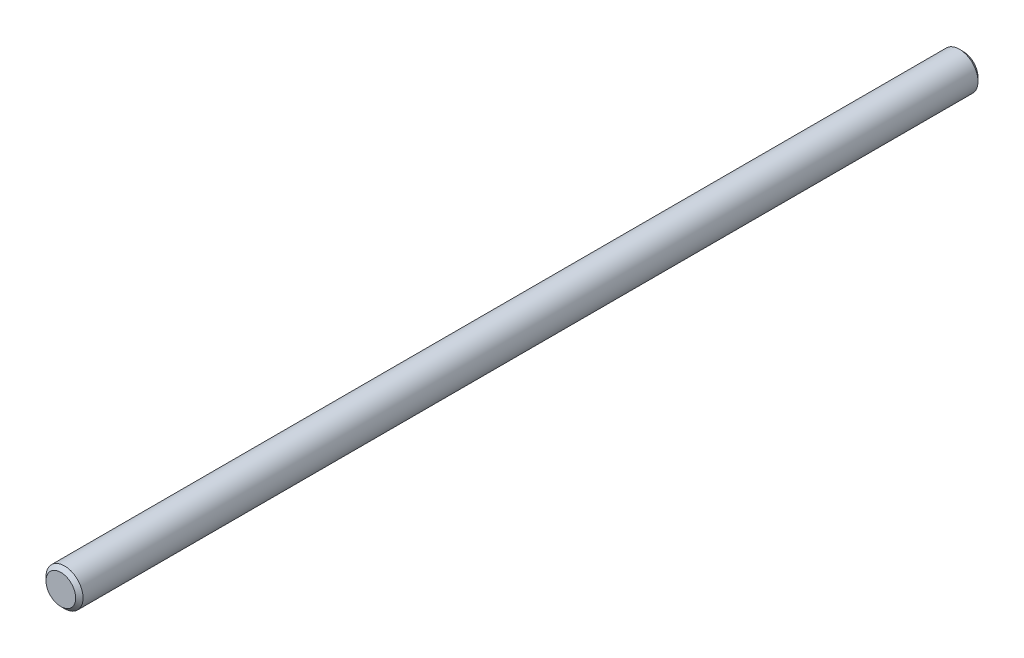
from build123d import *

# Parameters (mm, degrees)
ESQUISSE1_R      = 1.5
EXTRUSION1_DEPTH = 73
CHANFREIN1_SIZE  = 0.3


with BuildPart() as part:
    # Esquisse1 → Extrusion1 (new body)
    with BuildSketch(Plane.XY):
        Circle(ESQUISSE1_R)
    extrude(amount=EXTRUSION1_DEPTH)

    # Chanfrein1
    chanfrein1_edges = [part.edges().sort_by_distance(p)[0] for p in [
        (-1.5, 0, 0),
        (-1.5, 0, 73),
    ]]
    chamfer(chanfrein1_edges, length=CHANFREIN1_SIZE)


solid = part.part
